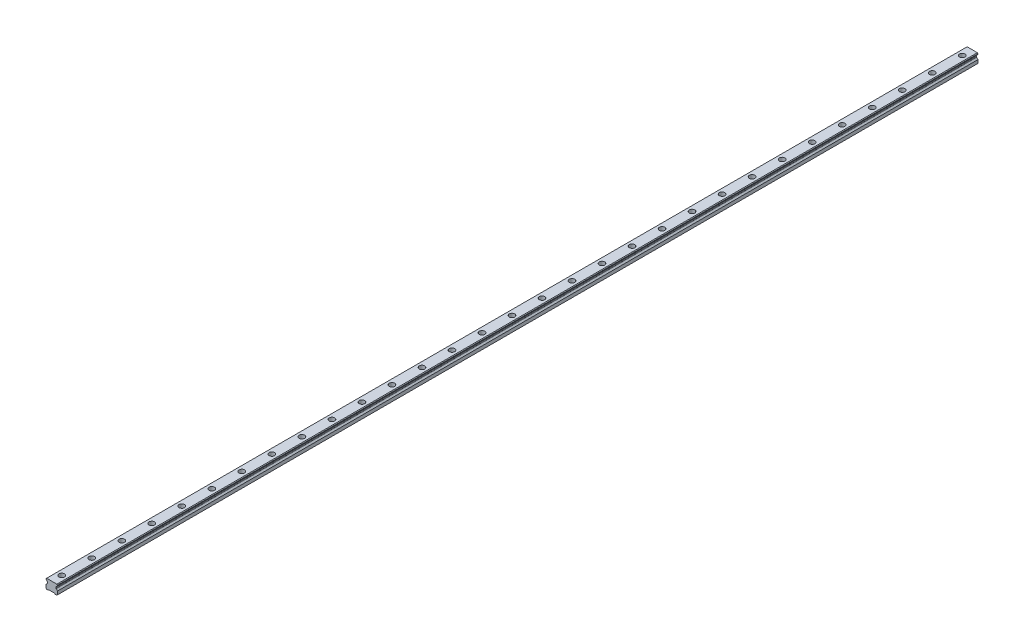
from build123d import *

# Parameters (mm, degrees)
SKETCH1_W           = 23
SKETCH1_H           = 19.2
BOSS_EXTRUDE1_DEPTH = 920
CUT_EXTRUDE1_DEPTH  = 1841.136106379
CHAMFER1_SIZE       = 1.25
FILLET1_R           = 1.25
CUT_EXTRUDE2_DEPTH  = 1841.136106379
SKETCH4_R           = 5.5
SKETCH4_R_2         = 3.5
CUT_EXTRUDE3_DEPTH  = 9
SKETCH4_2_R         = 3.5
CUT_EXTRUDE4_DEPTH  = 921.272182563
LPATTERN1_COUNT     = 31
LPATTERN1_PITCH     = 60


with BuildPart() as part:
    # Sketch1 → Boss-Extrude1 (new, symmetric)
    with BuildSketch(Plane.XY):
        with Locations((0, 9.6)):
            Rectangle(SKETCH1_W, SKETCH1_H)
    extrude(amount=BOSS_EXTRUDE1_DEPTH, both=True)

    # Sketch2 → Cut-Extrude1 (cut, through all)
    with BuildSketch(Plane.XY.offset(920)):
        Polygon((-11.5, 16.7), (-11.5, 7.95), (-8.583333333, 10.866666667), (-8.583333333, 13.783333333), align=None)
        Polygon((8.583333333, 13.783333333), (11.5, 16.7), (11.5, 7.95), (8.583333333, 10.866666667), align=None)
    extrude(amount=-CUT_EXTRUDE1_DEPTH, mode=Mode.SUBTRACT)

    # Chamfer1
    chamfer1_edges = [part.edges().sort_by_distance(p)[0] for p in [
        (-11.5, 19.2, 0),
        (11.5, 19.2, 0),
        (11.5, 0, 0),
        (-11.5, 0, 0),
    ]]
    chamfer(chamfer1_edges, length=CHAMFER1_SIZE)

    # Fillet1
    fillet1_edges = [part.edges().sort_by_distance(p)[0] for p in [
        (-8.583333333, 13.783333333, 0),
        (-8.583333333, 10.866666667, 0),
        (8.583333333, 10.866666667, 0),
        (8.583333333, 13.783333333, 0),
    ]]
    fillet(fillet1_edges, radius=FILLET1_R)

    # Sketch3 → Cut-Extrude2 (cut, through all)
    with BuildSketch(Plane.XY.offset(920)):
        Polygon((-7, 0), (-5.75, 1.25), (5.75, 1.25), (7, 0), align=None)
    extrude(amount=-CUT_EXTRUDE2_DEPTH, mode=Mode.SUBTRACT)

    # Sketch4 → Cut-Extrude3 (cut)
    with BuildSketch(Plane(origin=(0, 19.2, 0), x_dir=(1, 0, 0), z_dir=(0, 1, 0))):
        with Locations(Location((0, -900, 0), (0, 0, 270))):
            Circle(SKETCH4_R)
        with Locations(Location((0, -900, 0), (0, 0, 270))):
            Circle(SKETCH4_R_2, mode=Mode.SUBTRACT)
    cut_extrude3 = extrude(amount=-CUT_EXTRUDE3_DEPTH, mode=Mode.SUBTRACT)

    # Sketch4_2 → Cut-Extrude4 (cut, through all)
    with BuildSketch(Plane(origin=(0, 19.2, 0), x_dir=(1, 0, 0), z_dir=(0, 1, 0))):
        with Locations(Location((0, -900, 0), (0, 0, 270))):
            Circle(SKETCH4_2_R)
    cut_extrude4 = extrude(amount=-CUT_EXTRUDE4_DEPTH, mode=Mode.SUBTRACT)

    # LPattern1: Cut-Extrude3, Cut-Extrude4 ×31
    with Locations(*[(0, 0, -i * LPATTERN1_PITCH) for i in range(1, LPATTERN1_COUNT)]):
        add(cut_extrude3, mode=Mode.SUBTRACT)
        add(cut_extrude4, mode=Mode.SUBTRACT)


solid = part.part
